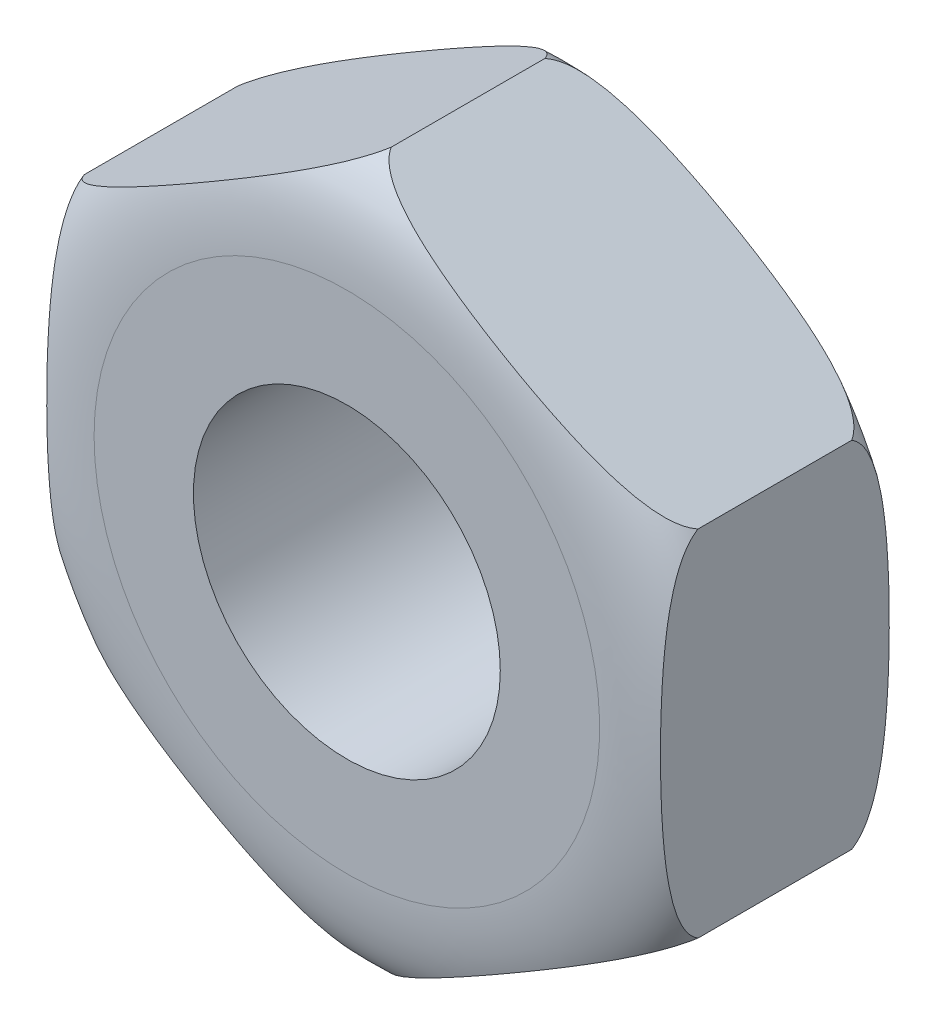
from build123d import *

# Parameters (mm, degrees)
ESQUISSE1_R      = 0.95
EXTRUSION1_DEPTH = 1.5


with BuildPart() as part:
    # Esquisse1 → Extrusion1 (new body)
    with BuildSketch(Plane.XY):
        Polygon((0, 2.193931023), (-1.9, 1.096965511), (-1.9, -1.096965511), (0, -2.193931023), (1.9, -1.096965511), (1.9, 1.096965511), align=None)
        Circle(ESQUISSE1_R, mode=Mode.SUBTRACT)
    extrude(amount=EXTRUSION1_DEPTH)

    # Esquisse3 → Enl_vement de mati_re-R_volution2 (revolve, cut)
    with BuildSketch(Plane(origin=(0, 0, 0), x_dir=(-0.8660254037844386, 0.5000000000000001, 0), z_dir=(-0.5000000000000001, -0.8660254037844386, 0))):
        with BuildLine():
            Line((-2.193931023, -0.274451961), (-2.193931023, -1.225548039))
            add(Edge.make_bspline(
                [(-1.519729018, -1.5), (-1.788235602, -1.503182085), (-2.126207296, -1.451267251), (-2.193931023, -1.225548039)],
                knots=[0, 0, 0, 0, 1, 1, 1, 1], degree=3))
            Line((-1.519729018, -1.5), (-1.519729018, -1.884609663))
            Line((-1.519729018, -1.884609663), (-2.5205263, -1.884609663))
            Line((-2.5205263, -1.884609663), (-2.5205263, 0.384609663))
            Line((-2.5205263, 0.384609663), (-1.519729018, 0.384609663))
            Line((-1.519729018, 0.384609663), (-1.519729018, 0))
            add(Edge.make_bspline(
                [(-1.519729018, 0), (-1.788235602, 0.003182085), (-2.126207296, -0.048732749), (-2.193931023, -0.274451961)],
                knots=[0, 0, 0, 0, 1, 1, 1, 1], degree=3))
        make_face()
    revolve(axis=Axis((0, 0, 0), (0, 0, 1)), mode=Mode.SUBTRACT)


solid = part.part
